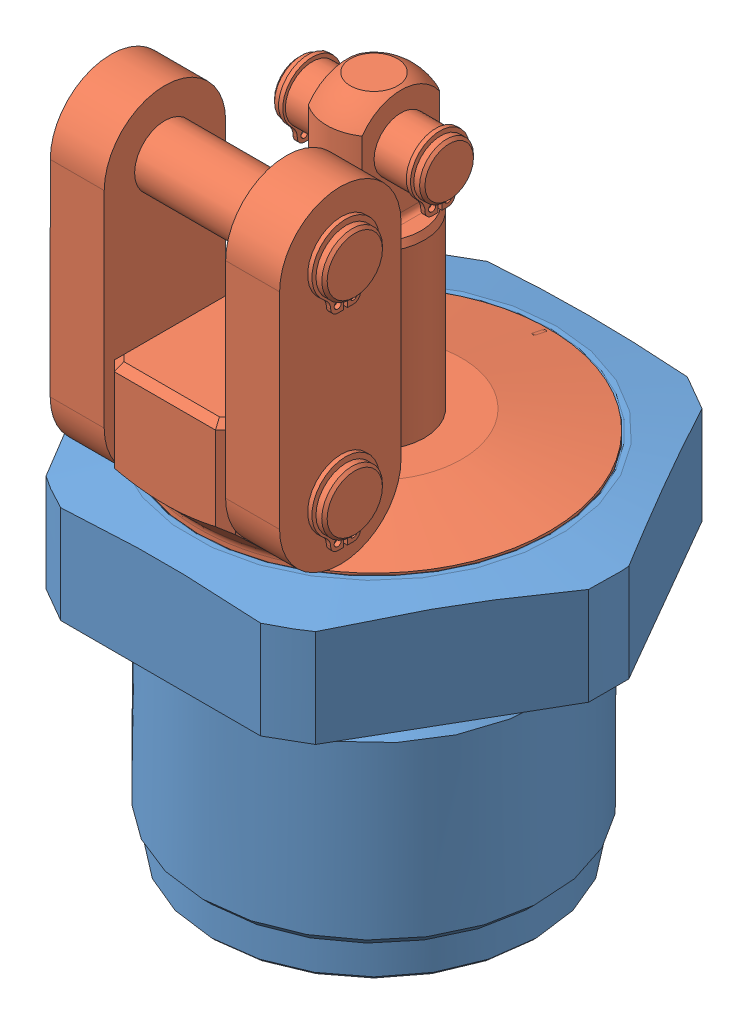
SolidWorks assembly ilcmv41621830.SLDASM, configuration Default (file format 13000). Lengths in mm.
Overall size (69.85 104.85 63.25).
2 component instances, 2 part files, 2 mates.
Components (placement in the parent):
- ilcmv41621830_BODY-1: ilcmv41621830_BODY.SLDPRT [Default] at (-63.0001 14.4527 31.1306) size (69.85 53.92 63.25)
- ilcmv41621830_LUG-1: ilcmv41621830_LUG.SLDPRT [Default] at (-63.0001 20.7519 31.1306) size (51.93 60.5 56.97)
Mates (geometry in assembly coordinates):
- Coincident1: coincident anti-aligned: plane of ilcmv41621830_BODY-1 through (-36.9651 20.7519 31.1306) normal (0 1 0); plane of ilmv41621830_LUG-1 through (-72.0001 20.7519 62.1306) normal (0 -1 0)
- Concentric1: concentric anti-aligned: cylinder of ilcmv41621830_BODY-1 through (-63.0001 5.4838 31.1306) axis (0 -1 0) radius 26.035; cylinder of ilmv41621830_LUG-1 through (-63.0001 37.3832 31.1306) axis (0 1 0) radius 25.965
